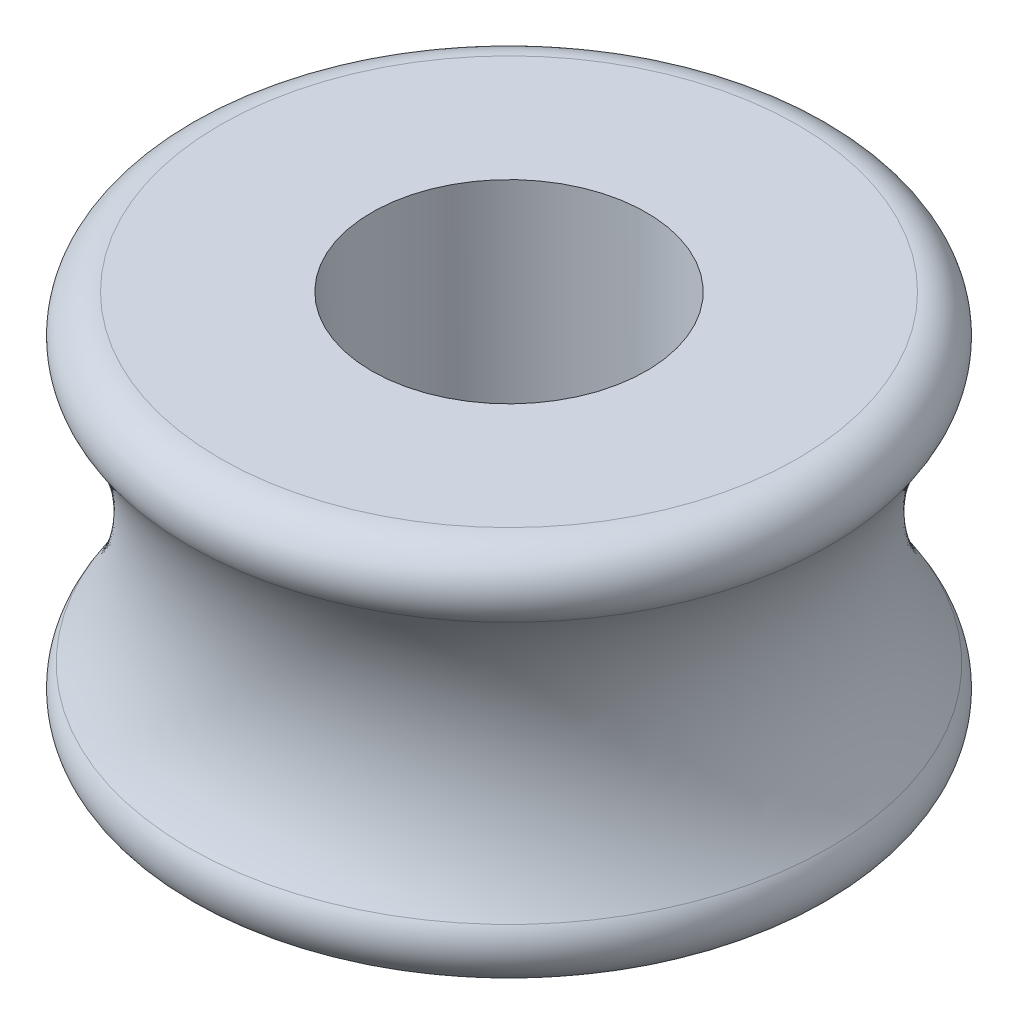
ISO-10303-21;
HEADER;
FILE_DESCRIPTION(('STEP AP214'),'2;1');
FILE_NAME('part.step','',(''),(''),'','','');
FILE_SCHEMA(('AUTOMOTIVE_DESIGN { 1 0 10303 214 1 1 1 1 }'));
ENDSEC;
DATA;
#1=APPLICATION_CONTEXT('core data for automotive mechanical design processes');
#2=APPLICATION_PROTOCOL_DEFINITION('international standard','automotive_design',2000,#1);
#3=PRODUCT_CONTEXT('',#1,'mechanical');
#4=PRODUCT('Part','Part','',(#3));
#5=PRODUCT_RELATED_PRODUCT_CATEGORY('part','',(#4));
#6=PRODUCT_DEFINITION_FORMATION('','',#4);
#7=PRODUCT_DEFINITION_CONTEXT('part definition',#1,'design');
#8=PRODUCT_DEFINITION('design','',#6,#7);
#9=PRODUCT_DEFINITION_SHAPE('','',#8);
#10=(LENGTH_UNIT() NAMED_UNIT(*) SI_UNIT(.MILLI.,.METRE.));
#11=(NAMED_UNIT(*) PLANE_ANGLE_UNIT() SI_UNIT($,.RADIAN.));
#12=(NAMED_UNIT(*) SI_UNIT($,.STERADIAN.) SOLID_ANGLE_UNIT());
#13=UNCERTAINTY_MEASURE_WITH_UNIT(LENGTH_MEASURE(1.E-05),#10,'distance_accuracy_value','');
#14=(GEOMETRIC_REPRESENTATION_CONTEXT(3) GLOBAL_UNCERTAINTY_ASSIGNED_CONTEXT((#13)) GLOBAL_UNIT_ASSIGNED_CONTEXT((#10,
#11,#12)) REPRESENTATION_CONTEXT('',''));
#15=CARTESIAN_POINT('',(0.,0.,0.));
#16=DIRECTION('',(0.,0.,1.));
#17=DIRECTION('',(1.,0.,0.));
#18=AXIS2_PLACEMENT_3D('',#15,#16,#17);
#19=CARTESIAN_POINT('',(0.,0.,0.));
#20=DIRECTION('',(0.,1.,0.));
#21=DIRECTION('',(0.,0.,1.));
#22=AXIS2_PLACEMENT_3D('',#19,#20,#21);
#23=CYLINDRICAL_SURFACE('',#22,1.8);
#24=CARTESIAN_POINT('',(0.,-4.5,0.));
#25=DIRECTION('',(0.,-1.,0.));
#26=DIRECTION('',(0.,0.,-1.));
#27=AXIS2_PLACEMENT_3D('',#24,#25,#26);
#28=CIRCLE('',#27,1.8);
#29=CARTESIAN_POINT('',(0.,-4.5,-1.8));
#30=VERTEX_POINT('',#29);
#31=EDGE_CURVE('E10',#30,#30,#28,.T.);
#32=ORIENTED_EDGE('',*,*,#31,.T.);
#33=EDGE_LOOP('',(#32));
#34=FACE_BOUND('',#33,.T.);
#35=CARTESIAN_POINT('',(0.,0.,0.));
#36=DIRECTION('',(0.,1.,0.));
#37=DIRECTION('',(0.,0.,1.));
#38=AXIS2_PLACEMENT_3D('',#35,#36,#37);
#39=CIRCLE('',#38,1.8);
#40=CARTESIAN_POINT('',(0.,0.,1.8));
#41=VERTEX_POINT('',#40);
#42=EDGE_CURVE('E62',#41,#41,#39,.T.);
#43=ORIENTED_EDGE('',*,*,#42,.T.);
#44=EDGE_LOOP('',(#43));
#45=FACE_BOUND('',#44,.T.);
#46=ADVANCED_FACE('F47',(#34,#45),#23,.F.);
#47=CARTESIAN_POINT('',(-3.78603107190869,0.,0.));
#48=DIRECTION('',(0.,1.,0.));
#49=DIRECTION('',(0.,0.,1.));
#50=AXIS2_PLACEMENT_3D('',#47,#48,#49);
#51=PLANE('',#50);
#52=CARTESIAN_POINT('',(0.,0.,0.));
#53=DIRECTION('',(0.,1.,0.));
#54=DIRECTION('',(0.,0.,1.));
#55=AXIS2_PLACEMENT_3D('',#52,#53,#54);
#56=CIRCLE('',#55,3.78603107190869);
#57=CARTESIAN_POINT('',(0.,0.,3.78603107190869));
#58=VERTEX_POINT('',#57);
#59=EDGE_CURVE('E67',#58,#58,#56,.T.);
#60=ORIENTED_EDGE('',*,*,#59,.T.);
#61=EDGE_LOOP('',(#60));
#62=FACE_BOUND('',#61,.T.);
#63=ORIENTED_EDGE('',*,*,#42,.F.);
#64=EDGE_LOOP('',(#63));
#65=FACE_BOUND('',#64,.T.);
#66=ADVANCED_FACE('F98',(#62,#65),#51,.T.);
#67=CARTESIAN_POINT('',(0.,-0.5,0.));
#68=DIRECTION('',(0.,1.,0.));
#69=DIRECTION('',(0.,0.,1.));
#70=AXIS2_PLACEMENT_3D('',#67,#68,#69);
#71=TOROIDAL_SURFACE('',#70,3.78603107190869,0.5);
#72=CARTESIAN_POINT('',(0.,-0.785714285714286,0.));
#73=DIRECTION('',(0.,1.,0.));
#74=DIRECTION('',(0.,0.,1.));
#75=AXIS2_PLACEMENT_3D('',#72,#73,#74);
#76=CIRCLE('',#75,4.19635697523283);
#77=CARTESIAN_POINT('',(0.,-0.785714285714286,4.19635697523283));
#78=VERTEX_POINT('',#77);
#79=EDGE_CURVE('E72',#78,#78,#76,.T.);
#80=ORIENTED_EDGE('',*,*,#79,.T.);
#81=EDGE_LOOP('',(#80));
#82=FACE_BOUND('',#81,.T.);
#83=ORIENTED_EDGE('',*,*,#59,.F.);
#84=EDGE_LOOP('',(#83));
#85=FACE_BOUND('',#84,.T.);
#86=ADVANCED_FACE('F101',(#82,#85),#71,.T.);
#87=CARTESIAN_POINT('',(0.,-2.5,0.));
#88=DIRECTION('',(0.,1.,0.));
#89=DIRECTION('',(0.,0.,1.));
#90=AXIS2_PLACEMENT_3D('',#87,#88,#89);
#91=TOROIDAL_SURFACE('',#90,6.6583123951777,3.);
#92=CARTESIAN_POINT('',(0.,-4.21428571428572,0.));
#93=DIRECTION('',(0.,1.,0.));
#94=DIRECTION('',(0.,0.,1.));
#95=AXIS2_PLACEMENT_3D('',#92,#93,#94);
#96=CIRCLE('',#95,4.19635697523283);
#97=CARTESIAN_POINT('',(0.,-4.21428571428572,4.19635697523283));
#98=VERTEX_POINT('',#97);
#99=EDGE_CURVE('E76',#98,#98,#96,.T.);
#100=ORIENTED_EDGE('',*,*,#99,.T.);
#101=EDGE_LOOP('',(#100));
#102=FACE_BOUND('',#101,.T.);
#103=ORIENTED_EDGE('',*,*,#79,.F.);
#104=EDGE_LOOP('',(#103));
#105=FACE_BOUND('',#104,.T.);
#106=ADVANCED_FACE('F95',(#102,#105),#91,.F.);
#107=CARTESIAN_POINT('',(0.,-4.5,0.));
#108=DIRECTION('',(0.,1.,0.));
#109=DIRECTION('',(0.,0.,1.));
#110=AXIS2_PLACEMENT_3D('',#107,#108,#109);
#111=TOROIDAL_SURFACE('',#110,3.78603107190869,0.5);
#112=CARTESIAN_POINT('',(0.,-5.,0.));
#113=DIRECTION('',(0.,1.,0.));
#114=DIRECTION('',(0.,0.,1.));
#115=AXIS2_PLACEMENT_3D('',#112,#113,#114);
#116=CIRCLE('',#115,3.78603107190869);
#117=CARTESIAN_POINT('',(0.,-5.,3.78603107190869));
#118=VERTEX_POINT('',#117);
#119=EDGE_CURVE('E80',#118,#118,#116,.T.);
#120=ORIENTED_EDGE('',*,*,#119,.T.);
#121=EDGE_LOOP('',(#120));
#122=FACE_BOUND('',#121,.T.);
#123=ORIENTED_EDGE('',*,*,#99,.F.);
#124=EDGE_LOOP('',(#123));
#125=FACE_BOUND('',#124,.T.);
#126=ADVANCED_FACE('F85',(#122,#125),#111,.T.);
#127=CARTESIAN_POINT('',(-1.8,-5.,0.));
#128=DIRECTION('',(0.,-1.,0.));
#129=DIRECTION('',(0.,0.,-1.));
#130=AXIS2_PLACEMENT_3D('',#127,#128,#129);
#131=PLANE('',#130);
#132=CARTESIAN_POINT('',(0.,-5.,0.));
#133=DIRECTION('',(0.,-1.,0.));
#134=DIRECTION('',(0.,0.,-1.));
#135=AXIS2_PLACEMENT_3D('',#132,#133,#134);
#136=CIRCLE('',#135,2.3);
#137=CARTESIAN_POINT('',(0.,-5.,-2.3));
#138=VERTEX_POINT('',#137);
#139=EDGE_CURVE('E56',#138,#138,#136,.F.);
#140=ORIENTED_EDGE('',*,*,#139,.T.);
#141=EDGE_LOOP('',(#140));
#142=FACE_BOUND('',#141,.T.);
#143=ORIENTED_EDGE('',*,*,#119,.F.);
#144=EDGE_LOOP('',(#143));
#145=FACE_BOUND('',#144,.T.);
#146=ADVANCED_FACE('F88',(#142,#145),#131,.T.);
#147=CARTESIAN_POINT('',(0.,-5.,0.));
#148=DIRECTION('',(0.,-1.,0.));
#149=DIRECTION('',(0.,0.,-1.));
#150=AXIS2_PLACEMENT_3D('',#147,#148,#149);
#151=CONICAL_SURFACE('',#150,2.3,0.785398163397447);
#152=ORIENTED_EDGE('',*,*,#31,.F.);
#153=EDGE_LOOP('',(#152));
#154=FACE_BOUND('',#153,.T.);
#155=ORIENTED_EDGE('',*,*,#139,.F.);
#156=EDGE_LOOP('',(#155));
#157=FACE_BOUND('',#156,.T.);
#158=ADVANCED_FACE('F50',(#154,#157),#151,.F.);
#159=CLOSED_SHELL('',(#46,#66,#86,#106,#126,#146,#158));
#160=MANIFOLD_SOLID_BREP('B2',#159);
#161=ADVANCED_BREP_SHAPE_REPRESENTATION('',(#18,#160),#14);
#162=SHAPE_DEFINITION_REPRESENTATION(#9,#161);
ENDSEC;
END-ISO-10303-21;
